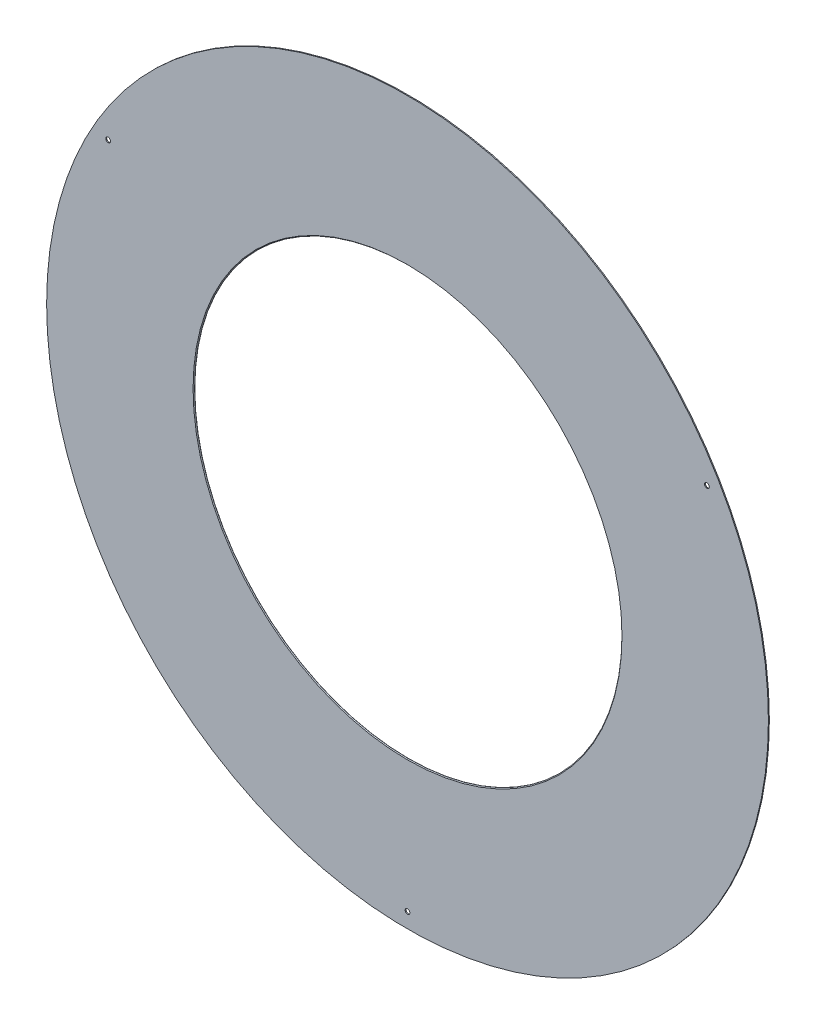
ISO-10303-21;
HEADER;
FILE_DESCRIPTION(('STEP AP214'),'2;1');
FILE_NAME('part.step','',(''),(''),'','','');
FILE_SCHEMA(('AUTOMOTIVE_DESIGN { 1 0 10303 214 1 1 1 1 }'));
ENDSEC;
DATA;
#1=APPLICATION_CONTEXT('core data for automotive mechanical design processes');
#2=APPLICATION_PROTOCOL_DEFINITION('international standard','automotive_design',2000,#1);
#3=PRODUCT_CONTEXT('',#1,'mechanical');
#4=PRODUCT('Part','Part','',(#3));
#5=PRODUCT_RELATED_PRODUCT_CATEGORY('part','',(#4));
#6=PRODUCT_DEFINITION_FORMATION('','',#4);
#7=PRODUCT_DEFINITION_CONTEXT('part definition',#1,'design');
#8=PRODUCT_DEFINITION('design','',#6,#7);
#9=PRODUCT_DEFINITION_SHAPE('','',#8);
#10=(LENGTH_UNIT() NAMED_UNIT(*) SI_UNIT(.MILLI.,.METRE.));
#11=(NAMED_UNIT(*) PLANE_ANGLE_UNIT() SI_UNIT($,.RADIAN.));
#12=(NAMED_UNIT(*) SI_UNIT($,.STERADIAN.) SOLID_ANGLE_UNIT());
#13=UNCERTAINTY_MEASURE_WITH_UNIT(LENGTH_MEASURE(1.E-05),#10,'distance_accuracy_value','');
#14=(GEOMETRIC_REPRESENTATION_CONTEXT(3) GLOBAL_UNCERTAINTY_ASSIGNED_CONTEXT((#13)) GLOBAL_UNIT_ASSIGNED_CONTEXT((#10,
#11,#12)) REPRESENTATION_CONTEXT('',''));
#15=CARTESIAN_POINT('',(0.,0.,0.));
#16=DIRECTION('',(0.,0.,1.));
#17=DIRECTION('',(1.,0.,0.));
#18=AXIS2_PLACEMENT_3D('',#15,#16,#17);
#19=CARTESIAN_POINT('',(0.,0.,1.5875));
#20=DIRECTION('',(0.,0.,1.));
#21=DIRECTION('',(1.,0.,0.));
#22=AXIS2_PLACEMENT_3D('',#19,#20,#21);
#23=PLANE('',#22);
#24=CARTESIAN_POINT('',(-500.432779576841,288.924999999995,1.5875));
#25=DIRECTION('',(0.,0.,1.));
#26=DIRECTION('',(1.,0.,0.));
#27=AXIS2_PLACEMENT_3D('',#24,#25,#26);
#28=CIRCLE('',#27,3.96874999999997);
#29=CARTESIAN_POINT('',(-496.464029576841,288.924999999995,1.5875));
#30=VERTEX_POINT('',#29);
#31=EDGE_CURVE('E69',#30,#30,#28,.T.);
#32=ORIENTED_EDGE('',*,*,#31,.F.);
#33=EDGE_LOOP('',(#32));
#34=FACE_BOUND('',#33,.T.);
#35=CARTESIAN_POINT('',(500.432779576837,288.925000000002,1.5875));
#36=DIRECTION('',(0.,0.,1.));
#37=DIRECTION('',(1.,0.,0.));
#38=AXIS2_PLACEMENT_3D('',#35,#36,#37);
#39=CIRCLE('',#38,3.96874999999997);
#40=CARTESIAN_POINT('',(504.401529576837,288.925000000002,1.5875));
#41=VERTEX_POINT('',#40);
#42=EDGE_CURVE('E63',#41,#41,#39,.T.);
#43=ORIENTED_EDGE('',*,*,#42,.F.);
#44=EDGE_LOOP('',(#43));
#45=FACE_BOUND('',#44,.T.);
#46=CARTESIAN_POINT('',(0.,-577.85,1.5875));
#47=DIRECTION('',(0.,0.,1.));
#48=DIRECTION('',(1.,0.,0.));
#49=AXIS2_PLACEMENT_3D('',#46,#47,#48);
#50=CIRCLE('',#49,3.96874999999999);
#51=CARTESIAN_POINT('',(3.96874999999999,-577.85,1.5875));
#52=VERTEX_POINT('',#51);
#53=EDGE_CURVE('E57',#52,#52,#50,.T.);
#54=ORIENTED_EDGE('',*,*,#53,.F.);
#55=EDGE_LOOP('',(#54));
#56=FACE_BOUND('',#55,.T.);
#57=CARTESIAN_POINT('',(0.,0.,1.5875));
#58=DIRECTION('',(0.,0.,1.));
#59=DIRECTION('',(1.,0.,0.));
#60=AXIS2_PLACEMENT_3D('',#57,#58,#59);
#61=CIRCLE('',#60,358.4575);
#62=CARTESIAN_POINT('',(358.4575,0.,1.5875));
#63=VERTEX_POINT('',#62);
#64=EDGE_CURVE('E10',#63,#63,#61,.F.);
#65=ORIENTED_EDGE('',*,*,#64,.T.);
#66=EDGE_LOOP('',(#65));
#67=FACE_BOUND('',#66,.T.);
#68=CARTESIAN_POINT('',(0.,0.,1.5875));
#69=DIRECTION('',(0.,0.,1.));
#70=DIRECTION('',(1.,0.,0.));
#71=AXIS2_PLACEMENT_3D('',#68,#69,#70);
#72=CIRCLE('',#71,603.25);
#73=CARTESIAN_POINT('',(603.25,0.,1.5875));
#74=VERTEX_POINT('',#73);
#75=EDGE_CURVE('E42',#74,#74,#72,.T.);
#76=ORIENTED_EDGE('',*,*,#75,.T.);
#77=EDGE_LOOP('',(#76));
#78=FACE_BOUND('',#77,.T.);
#79=ADVANCED_FACE('F31',(#34,#45,#56,#67,#78),#23,.T.);
#80=CARTESIAN_POINT('',(0.,0.,0.));
#81=DIRECTION('',(0.,0.,1.));
#82=DIRECTION('',(1.,0.,0.));
#83=AXIS2_PLACEMENT_3D('',#80,#81,#82);
#84=PLANE('',#83);
#85=CARTESIAN_POINT('',(-500.432779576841,288.924999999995,0.));
#86=DIRECTION('',(0.,0.,1.));
#87=DIRECTION('',(1.,0.,0.));
#88=AXIS2_PLACEMENT_3D('',#85,#86,#87);
#89=CIRCLE('',#88,3.96874999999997);
#90=CARTESIAN_POINT('',(-496.464029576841,288.924999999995,0.));
#91=VERTEX_POINT('',#90);
#92=EDGE_CURVE('E66',#91,#91,#89,.T.);
#93=ORIENTED_EDGE('',*,*,#92,.T.);
#94=EDGE_LOOP('',(#93));
#95=FACE_BOUND('',#94,.T.);
#96=CARTESIAN_POINT('',(500.432779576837,288.925000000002,0.));
#97=DIRECTION('',(0.,0.,1.));
#98=DIRECTION('',(1.,0.,0.));
#99=AXIS2_PLACEMENT_3D('',#96,#97,#98);
#100=CIRCLE('',#99,3.96874999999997);
#101=CARTESIAN_POINT('',(504.401529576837,288.925000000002,0.));
#102=VERTEX_POINT('',#101);
#103=EDGE_CURVE('E60',#102,#102,#100,.T.);
#104=ORIENTED_EDGE('',*,*,#103,.T.);
#105=EDGE_LOOP('',(#104));
#106=FACE_BOUND('',#105,.T.);
#107=CARTESIAN_POINT('',(0.,-577.85,0.));
#108=DIRECTION('',(0.,0.,1.));
#109=DIRECTION('',(1.,0.,0.));
#110=AXIS2_PLACEMENT_3D('',#107,#108,#109);
#111=CIRCLE('',#110,3.96874999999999);
#112=CARTESIAN_POINT('',(3.96874999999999,-577.85,0.));
#113=VERTEX_POINT('',#112);
#114=EDGE_CURVE('E54',#113,#113,#111,.T.);
#115=ORIENTED_EDGE('',*,*,#114,.T.);
#116=EDGE_LOOP('',(#115));
#117=FACE_BOUND('',#116,.T.);
#118=CARTESIAN_POINT('',(0.,0.,0.));
#119=DIRECTION('',(0.,0.,1.));
#120=DIRECTION('',(1.,0.,0.));
#121=AXIS2_PLACEMENT_3D('',#118,#119,#120);
#122=CIRCLE('',#121,603.25);
#123=CARTESIAN_POINT('',(603.25,0.,0.));
#124=VERTEX_POINT('',#123);
#125=EDGE_CURVE('E46',#124,#124,#122,.T.);
#126=ORIENTED_EDGE('',*,*,#125,.F.);
#127=EDGE_LOOP('',(#126));
#128=FACE_BOUND('',#127,.T.);
#129=CARTESIAN_POINT('',(0.,0.,0.));
#130=DIRECTION('',(0.,0.,1.));
#131=DIRECTION('',(1.,0.,0.));
#132=AXIS2_PLACEMENT_3D('',#129,#130,#131);
#133=CIRCLE('',#132,357.1875);
#134=CARTESIAN_POINT('',(357.1875,0.,0.));
#135=VERTEX_POINT('',#134);
#136=EDGE_CURVE('E50',#135,#135,#133,.T.);
#137=ORIENTED_EDGE('',*,*,#136,.T.);
#138=EDGE_LOOP('',(#137));
#139=FACE_BOUND('',#138,.T.);
#140=ADVANCED_FACE('F77',(#95,#106,#117,#128,#139),#84,.F.);
#141=CARTESIAN_POINT('',(0.,0.,1.5875));
#142=DIRECTION('',(0.,0.,-1.));
#143=DIRECTION('',(-1.,0.,0.));
#144=AXIS2_PLACEMENT_3D('',#141,#142,#143);
#145=CYLINDRICAL_SURFACE('',#144,603.25);
#146=ORIENTED_EDGE('',*,*,#75,.F.);
#147=EDGE_LOOP('',(#146));
#148=FACE_BOUND('',#147,.T.);
#149=ORIENTED_EDGE('',*,*,#125,.T.);
#150=EDGE_LOOP('',(#149));
#151=FACE_BOUND('',#150,.T.);
#152=ADVANCED_FACE('F85',(#148,#151),#145,.T.);
#153=CARTESIAN_POINT('',(0.,0.,1.5875));
#154=DIRECTION('',(0.,0.,-1.));
#155=DIRECTION('',(-1.,0.,0.));
#156=AXIS2_PLACEMENT_3D('',#153,#154,#155);
#157=CYLINDRICAL_SURFACE('',#156,357.1875);
#158=CARTESIAN_POINT('',(0.,0.,0.317499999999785));
#159=DIRECTION('',(0.,0.,1.));
#160=DIRECTION('',(1.,0.,0.));
#161=AXIS2_PLACEMENT_3D('',#158,#159,#160);
#162=CIRCLE('',#161,357.1875);
#163=CARTESIAN_POINT('',(357.1875,0.,0.317499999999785));
#164=VERTEX_POINT('',#163);
#165=EDGE_CURVE('E38',#164,#164,#162,.T.);
#166=ORIENTED_EDGE('',*,*,#165,.T.);
#167=EDGE_LOOP('',(#166));
#168=FACE_BOUND('',#167,.T.);
#169=ORIENTED_EDGE('',*,*,#136,.F.);
#170=EDGE_LOOP('',(#169));
#171=FACE_BOUND('',#170,.T.);
#172=ADVANCED_FACE('F88',(#168,#171),#157,.F.);
#173=CARTESIAN_POINT('',(0.,0.,0.317499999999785));
#174=DIRECTION('',(0.,0.,1.));
#175=DIRECTION('',(1.,0.,0.));
#176=AXIS2_PLACEMENT_3D('',#173,#174,#175);
#177=CONICAL_SURFACE('',#176,357.1875,0.78539816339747);
#178=ORIENTED_EDGE('',*,*,#64,.F.);
#179=EDGE_LOOP('',(#178));
#180=FACE_BOUND('',#179,.T.);
#181=ORIENTED_EDGE('',*,*,#165,.F.);
#182=EDGE_LOOP('',(#181));
#183=FACE_BOUND('',#182,.T.);
#184=ADVANCED_FACE('F33',(#180,#183),#177,.F.);
#185=CARTESIAN_POINT('',(0.,-577.85,1.5875));
#186=DIRECTION('',(0.,0.,1.));
#187=DIRECTION('',(1.,0.,0.));
#188=AXIS2_PLACEMENT_3D('',#185,#186,#187);
#189=CYLINDRICAL_SURFACE('',#188,3.96874999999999);
#190=ORIENTED_EDGE('',*,*,#114,.F.);
#191=EDGE_LOOP('',(#190));
#192=FACE_BOUND('',#191,.T.);
#193=ORIENTED_EDGE('',*,*,#53,.T.);
#194=EDGE_LOOP('',(#193));
#195=FACE_BOUND('',#194,.T.);
#196=ADVANCED_FACE('F102',(#192,#195),#189,.F.);
#197=CARTESIAN_POINT('',(500.432779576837,288.925000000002,1.5875));
#198=DIRECTION('',(0.,0.,1.));
#199=DIRECTION('',(1.,0.,0.));
#200=AXIS2_PLACEMENT_3D('',#197,#198,#199);
#201=CYLINDRICAL_SURFACE('',#200,3.96874999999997);
#202=ORIENTED_EDGE('',*,*,#103,.F.);
#203=EDGE_LOOP('',(#202));
#204=FACE_BOUND('',#203,.T.);
#205=ORIENTED_EDGE('',*,*,#42,.T.);
#206=EDGE_LOOP('',(#205));
#207=FACE_BOUND('',#206,.T.);
#208=ADVANCED_FACE('F107',(#204,#207),#201,.F.);
#209=CARTESIAN_POINT('',(-500.432779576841,288.924999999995,1.5875));
#210=DIRECTION('',(0.,0.,1.));
#211=DIRECTION('',(1.,0.,0.));
#212=AXIS2_PLACEMENT_3D('',#209,#210,#211);
#213=CYLINDRICAL_SURFACE('',#212,3.96874999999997);
#214=ORIENTED_EDGE('',*,*,#92,.F.);
#215=EDGE_LOOP('',(#214));
#216=FACE_BOUND('',#215,.T.);
#217=ORIENTED_EDGE('',*,*,#31,.T.);
#218=EDGE_LOOP('',(#217));
#219=FACE_BOUND('',#218,.T.);
#220=ADVANCED_FACE('F73',(#216,#219),#213,.F.);
#221=CLOSED_SHELL('',(#79,#140,#152,#172,#184,#196,#208,#220));
#222=MANIFOLD_SOLID_BREP('B2',#221);
#223=ADVANCED_BREP_SHAPE_REPRESENTATION('',(#18,#222),#14);
#224=SHAPE_DEFINITION_REPRESENTATION(#9,#223);
ENDSEC;
END-ISO-10303-21;
